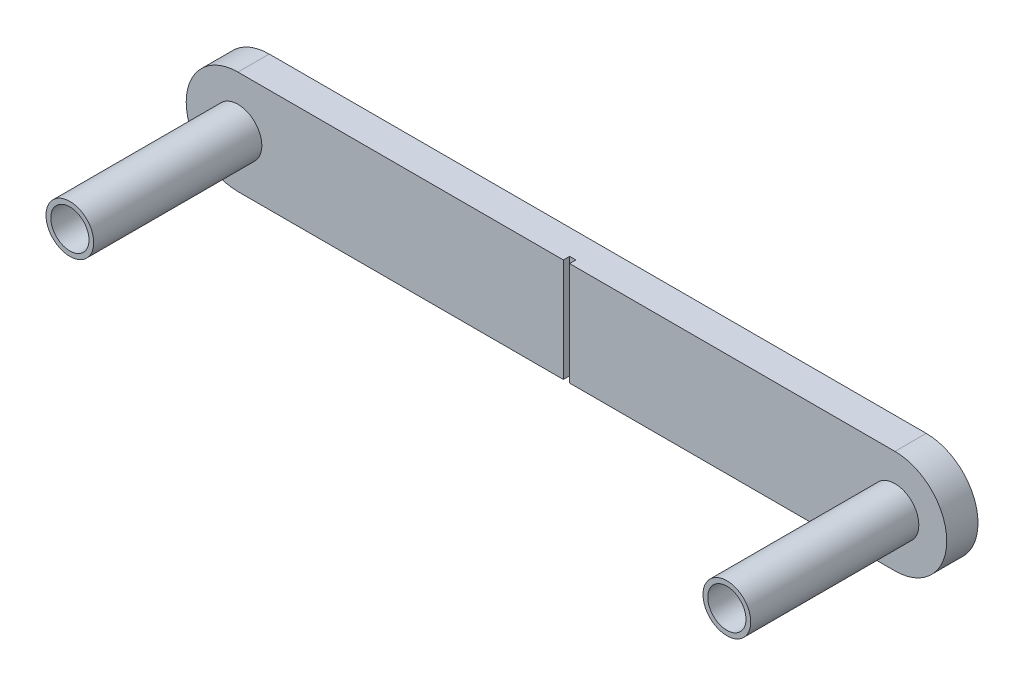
ISO-10303-21;
HEADER;
FILE_DESCRIPTION(('STEP AP214'),'2;1');
FILE_NAME('part.step','',(''),(''),'','','');
FILE_SCHEMA(('AUTOMOTIVE_DESIGN { 1 0 10303 214 1 1 1 1 }'));
ENDSEC;
DATA;
#1=APPLICATION_CONTEXT('core data for automotive mechanical design processes');
#2=APPLICATION_PROTOCOL_DEFINITION('international standard','automotive_design',2000,#1);
#3=PRODUCT_CONTEXT('',#1,'mechanical');
#4=PRODUCT('Part','Part','',(#3));
#5=PRODUCT_RELATED_PRODUCT_CATEGORY('part','',(#4));
#6=PRODUCT_DEFINITION_FORMATION('','',#4);
#7=PRODUCT_DEFINITION_CONTEXT('part definition',#1,'design');
#8=PRODUCT_DEFINITION('design','',#6,#7);
#9=PRODUCT_DEFINITION_SHAPE('','',#8);
#10=(LENGTH_UNIT() NAMED_UNIT(*) SI_UNIT(.MILLI.,.METRE.));
#11=(NAMED_UNIT(*) PLANE_ANGLE_UNIT() SI_UNIT($,.RADIAN.));
#12=(NAMED_UNIT(*) SI_UNIT($,.STERADIAN.) SOLID_ANGLE_UNIT());
#13=UNCERTAINTY_MEASURE_WITH_UNIT(LENGTH_MEASURE(1.E-05),#10,'distance_accuracy_value','');
#14=(GEOMETRIC_REPRESENTATION_CONTEXT(3) GLOBAL_UNCERTAINTY_ASSIGNED_CONTEXT((#13)) GLOBAL_UNIT_ASSIGNED_CONTEXT((#10,
#11,#12)) REPRESENTATION_CONTEXT('',''));
#15=CARTESIAN_POINT('',(0.,0.,0.));
#16=DIRECTION('',(0.,0.,1.));
#17=DIRECTION('',(1.,0.,0.));
#18=AXIS2_PLACEMENT_3D('',#15,#16,#17);
#19=CARTESIAN_POINT('',(353.595340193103,142.140968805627,-53.73));
#20=DIRECTION('',(0.,0.,-1.));
#21=DIRECTION('',(-1.,0.,0.));
#22=AXIS2_PLACEMENT_3D('',#19,#20,#21);
#23=PLANE('',#22);
#24=CARTESIAN_POINT('',(353.595340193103,142.140968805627,-53.73));
#25=DIRECTION('',(0.,0.,-1.));
#26=DIRECTION('',(-1.,0.,0.));
#27=AXIS2_PLACEMENT_3D('',#24,#25,#26);
#28=CIRCLE('',#27,7.62500000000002);
#29=CARTESIAN_POINT('',(345.970340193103,142.140968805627,-53.73));
#30=VERTEX_POINT('',#29);
#31=EDGE_CURVE('E149',#30,#30,#28,.F.);
#32=ORIENTED_EDGE('',*,*,#31,.F.);
#33=EDGE_LOOP('',(#32));
#34=FACE_BOUND('',#33,.T.);
#35=DIRECTION('',(1.,0.,0.));
#36=VECTOR('',#35,1.);
#37=CARTESIAN_POINT('',(143.595340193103,158.684747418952,-53.73));
#38=LINE('',#37,#36);
#39=CARTESIAN_POINT('',(249.595340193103,158.684747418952,-53.73));
#40=VERTEX_POINT('',#39);
#41=CARTESIAN_POINT('',(353.595340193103,158.684747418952,-53.73));
#42=VERTEX_POINT('',#41);
#43=EDGE_CURVE('E112',#40,#42,#38,.T.);
#44=ORIENTED_EDGE('',*,*,#43,.F.);
#45=DIRECTION('',(0.,1.,0.));
#46=VECTOR('',#45,1.);
#47=CARTESIAN_POINT('',(249.595340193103,158.684747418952,-53.73));
#48=LINE('',#47,#46);
#49=CARTESIAN_POINT('',(249.595340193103,125.597190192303,-53.73));
#50=VERTEX_POINT('',#49);
#51=EDGE_CURVE('E99',#50,#40,#48,.T.);
#52=ORIENTED_EDGE('',*,*,#51,.F.);
#53=DIRECTION('',(-1.,0.,0.));
#54=VECTOR('',#53,1.);
#55=CARTESIAN_POINT('',(353.595340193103,125.597190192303,-53.73));
#56=LINE('',#55,#54);
#57=CARTESIAN_POINT('',(353.595340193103,125.597190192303,-53.73));
#58=VERTEX_POINT('',#57);
#59=EDGE_CURVE('E128',#58,#50,#56,.T.);
#60=ORIENTED_EDGE('',*,*,#59,.F.);
#61=CARTESIAN_POINT('',(353.595340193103,142.140968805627,-53.73));
#62=DIRECTION('',(0.,0.,-1.));
#63=DIRECTION('',(-1.,0.,0.));
#64=AXIS2_PLACEMENT_3D('',#61,#62,#63);
#65=CIRCLE('',#64,16.5437786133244);
#66=EDGE_CURVE('E122',#42,#58,#65,.T.);
#67=ORIENTED_EDGE('',*,*,#66,.F.);
#68=EDGE_LOOP('',(#44,#52,#60,#67));
#69=FACE_BOUND('',#68,.T.);
#70=ADVANCED_FACE('F34',(#34,#69),#23,.F.);
#71=CARTESIAN_POINT('',(247.595340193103,125.597190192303,-53.73));
#72=VERTEX_POINT('',#71);
#73=CARTESIAN_POINT('',(143.595340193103,125.597190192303,-53.73));
#74=VERTEX_POINT('',#73);
#75=EDGE_CURVE('E196',#72,#74,#56,.T.);
#76=ORIENTED_EDGE('',*,*,#75,.F.);
#77=DIRECTION('',(0.,-1.,0.));
#78=VECTOR('',#77,1.);
#79=CARTESIAN_POINT('',(247.595340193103,158.684747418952,-53.73));
#80=LINE('',#79,#78);
#81=CARTESIAN_POINT('',(247.595340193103,158.684747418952,-53.73));
#82=VERTEX_POINT('',#81);
#83=EDGE_CURVE('E106',#82,#72,#80,.T.);
#84=ORIENTED_EDGE('',*,*,#83,.F.);
#85=CARTESIAN_POINT('',(143.595340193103,158.684747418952,-53.73));
#86=VERTEX_POINT('',#85);
#87=EDGE_CURVE('E123',#86,#82,#38,.T.);
#88=ORIENTED_EDGE('',*,*,#87,.F.);
#89=CARTESIAN_POINT('',(143.595340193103,142.140968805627,-53.73));
#90=DIRECTION('',(0.,0.,-1.));
#91=DIRECTION('',(1.,0.,0.));
#92=AXIS2_PLACEMENT_3D('',#89,#90,#91);
#93=CIRCLE('',#92,16.5437786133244);
#94=EDGE_CURVE('E124',#74,#86,#93,.T.);
#95=ORIENTED_EDGE('',*,*,#94,.F.);
#96=EDGE_LOOP('',(#76,#84,#88,#95));
#97=FACE_BOUND('',#96,.T.);
#98=CARTESIAN_POINT('',(143.595340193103,142.140968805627,-53.73));
#99=DIRECTION('',(0.,0.,-1.));
#100=DIRECTION('',(-1.,0.,0.));
#101=AXIS2_PLACEMENT_3D('',#98,#99,#100);
#102=CIRCLE('',#101,7.62499999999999);
#103=CARTESIAN_POINT('',(135.970340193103,142.140968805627,-53.73));
#104=VERTEX_POINT('',#103);
#105=EDGE_CURVE('E11',#104,#104,#102,.F.);
#106=ORIENTED_EDGE('',*,*,#105,.F.);
#107=EDGE_LOOP('',(#106));
#108=FACE_BOUND('',#107,.T.);
#109=ADVANCED_FACE('F157',(#97,#108),#23,.F.);
#110=CARTESIAN_POINT('',(353.595340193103,142.140968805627,-53.73));
#111=DIRECTION('',(0.,0.,1.));
#112=DIRECTION('',(1.,0.,0.));
#113=AXIS2_PLACEMENT_3D('',#110,#111,#112);
#114=CYLINDRICAL_SURFACE('',#113,7.62500000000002);
#115=ORIENTED_EDGE('',*,*,#31,.T.);
#116=EDGE_LOOP('',(#115));
#117=FACE_BOUND('',#116,.T.);
#118=CARTESIAN_POINT('',(353.595340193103,142.140968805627,0.));
#119=DIRECTION('',(0.,0.,1.));
#120=DIRECTION('',(1.,0.,0.));
#121=AXIS2_PLACEMENT_3D('',#118,#119,#120);
#122=CIRCLE('',#121,7.62500000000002);
#123=CARTESIAN_POINT('',(361.220340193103,142.140968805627,0.));
#124=VERTEX_POINT('',#123);
#125=EDGE_CURVE('E42',#124,#124,#122,.T.);
#126=ORIENTED_EDGE('',*,*,#125,.F.);
#127=EDGE_LOOP('',(#126));
#128=FACE_BOUND('',#127,.T.);
#129=ADVANCED_FACE('F36',(#117,#128),#114,.T.);
#130=CARTESIAN_POINT('',(353.595340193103,142.140968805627,0.));
#131=DIRECTION('',(0.,0.,1.));
#132=DIRECTION('',(1.,0.,0.));
#133=AXIS2_PLACEMENT_3D('',#130,#131,#132);
#134=PLANE('',#133);
#135=CARTESIAN_POINT('',(353.595340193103,142.140968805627,0.));
#136=DIRECTION('',(0.,0.,1.));
#137=DIRECTION('',(1.,0.,0.));
#138=AXIS2_PLACEMENT_3D('',#135,#136,#137);
#139=CIRCLE('',#138,6.11000000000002);
#140=CARTESIAN_POINT('',(359.705340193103,142.140968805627,0.));
#141=VERTEX_POINT('',#140);
#142=EDGE_CURVE('E261',#141,#141,#139,.T.);
#143=ORIENTED_EDGE('',*,*,#142,.F.);
#144=EDGE_LOOP('',(#143));
#145=FACE_BOUND('',#144,.T.);
#146=ORIENTED_EDGE('',*,*,#125,.T.);
#147=EDGE_LOOP('',(#146));
#148=FACE_BOUND('',#147,.T.);
#149=ADVANCED_FACE('F154',(#145,#148),#134,.T.);
#150=CARTESIAN_POINT('',(353.595340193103,142.140968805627,-63.73));
#151=DIRECTION('',(0.,0.,1.));
#152=DIRECTION('',(1.,0.,0.));
#153=AXIS2_PLACEMENT_3D('',#150,#151,#152);
#154=CYLINDRICAL_SURFACE('',#153,16.5437786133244);
#155=ORIENTED_EDGE('',*,*,#66,.T.);
#156=DIRECTION('',(0.,0.,1.));
#157=VECTOR('',#156,1.);
#158=CARTESIAN_POINT('',(353.595340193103,125.597190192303,-63.73));
#159=LINE('',#158,#157);
#160=CARTESIAN_POINT('',(353.595340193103,125.597190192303,-63.73));
#161=VERTEX_POINT('',#160);
#162=EDGE_CURVE('E146',#161,#58,#159,.T.);
#163=ORIENTED_EDGE('',*,*,#162,.F.);
#164=CARTESIAN_POINT('',(353.595340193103,142.140968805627,-63.73));
#165=DIRECTION('',(0.,0.,-1.));
#166=DIRECTION('',(-1.,0.,0.));
#167=AXIS2_PLACEMENT_3D('',#164,#165,#166);
#168=CIRCLE('',#167,16.5437786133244);
#169=CARTESIAN_POINT('',(353.595340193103,158.684747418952,-63.73));
#170=VERTEX_POINT('',#169);
#171=EDGE_CURVE('E127',#170,#161,#168,.T.);
#172=ORIENTED_EDGE('',*,*,#171,.F.);
#173=DIRECTION('',(0.,0.,1.));
#174=VECTOR('',#173,1.);
#175=CARTESIAN_POINT('',(353.595340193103,158.684747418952,-63.73));
#176=LINE('',#175,#174);
#177=EDGE_CURVE('E138',#170,#42,#176,.T.);
#178=ORIENTED_EDGE('',*,*,#177,.T.);
#179=EDGE_LOOP('',(#155,#163,#172,#178));
#180=FACE_BOUND('',#179,.T.);
#181=ADVANCED_FACE('F163',(#180),#154,.T.);
#182=CARTESIAN_POINT('',(353.595340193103,125.597190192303,-63.73));
#183=DIRECTION('',(0.,1.,0.));
#184=DIRECTION('',(0.,0.,1.));
#185=AXIS2_PLACEMENT_3D('',#182,#183,#184);
#186=PLANE('',#185);
#187=ORIENTED_EDGE('',*,*,#59,.T.);
#188=DIRECTION('',(0.,0.,-1.));
#189=VECTOR('',#188,1.);
#190=CARTESIAN_POINT('',(249.595340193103,125.597190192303,-63.73));
#191=LINE('',#190,#189);
#192=CARTESIAN_POINT('',(249.595340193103,125.597190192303,-55.73));
#193=VERTEX_POINT('',#192);
#194=EDGE_CURVE('E102',#50,#193,#191,.T.);
#195=ORIENTED_EDGE('',*,*,#194,.T.);
#196=DIRECTION('',(1.,0.,0.));
#197=VECTOR('',#196,1.);
#198=CARTESIAN_POINT('',(353.595340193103,125.597190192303,-55.73));
#199=LINE('',#198,#197);
#200=CARTESIAN_POINT('',(247.595340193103,125.597190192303,-55.73));
#201=VERTEX_POINT('',#200);
#202=EDGE_CURVE('E221',#201,#193,#199,.T.);
#203=ORIENTED_EDGE('',*,*,#202,.F.);
#204=DIRECTION('',(0.,0.,1.));
#205=VECTOR('',#204,1.);
#206=CARTESIAN_POINT('',(247.595340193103,125.597190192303,-63.73));
#207=LINE('',#206,#205);
#208=EDGE_CURVE('E224',#201,#72,#207,.T.);
#209=ORIENTED_EDGE('',*,*,#208,.T.);
#210=ORIENTED_EDGE('',*,*,#75,.T.);
#211=DIRECTION('',(0.,0.,1.));
#212=VECTOR('',#211,1.);
#213=CARTESIAN_POINT('',(143.595340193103,125.597190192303,-63.73));
#214=LINE('',#213,#212);
#215=CARTESIAN_POINT('',(143.595340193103,125.597190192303,-63.73));
#216=VERTEX_POINT('',#215);
#217=EDGE_CURVE('E143',#216,#74,#214,.T.);
#218=ORIENTED_EDGE('',*,*,#217,.F.);
#219=DIRECTION('',(-1.,0.,0.));
#220=VECTOR('',#219,1.);
#221=CARTESIAN_POINT('',(353.595340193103,125.597190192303,-63.73));
#222=LINE('',#221,#220);
#223=EDGE_CURVE('E133',#161,#216,#222,.T.);
#224=ORIENTED_EDGE('',*,*,#223,.F.);
#225=ORIENTED_EDGE('',*,*,#162,.T.);
#226=EDGE_LOOP('',(#187,#195,#203,#209,#210,#218,#224,#225));
#227=FACE_BOUND('',#226,.T.);
#228=ADVANCED_FACE('F185',(#227),#186,.F.);
#229=CARTESIAN_POINT('',(143.595340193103,142.140968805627,-63.73));
#230=DIRECTION('',(0.,0.,1.));
#231=DIRECTION('',(1.,0.,0.));
#232=AXIS2_PLACEMENT_3D('',#229,#230,#231);
#233=CYLINDRICAL_SURFACE('',#232,16.5437786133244);
#234=ORIENTED_EDGE('',*,*,#94,.T.);
#235=DIRECTION('',(0.,0.,1.));
#236=VECTOR('',#235,1.);
#237=CARTESIAN_POINT('',(143.595340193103,158.684747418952,-63.73));
#238=LINE('',#237,#236);
#239=CARTESIAN_POINT('',(143.595340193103,158.684747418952,-63.73));
#240=VERTEX_POINT('',#239);
#241=EDGE_CURVE('E140',#240,#86,#238,.T.);
#242=ORIENTED_EDGE('',*,*,#241,.F.);
#243=CARTESIAN_POINT('',(143.595340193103,142.140968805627,-63.73));
#244=DIRECTION('',(0.,0.,-1.));
#245=DIRECTION('',(1.,0.,0.));
#246=AXIS2_PLACEMENT_3D('',#243,#244,#245);
#247=CIRCLE('',#246,16.5437786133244);
#248=EDGE_CURVE('E135',#216,#240,#247,.T.);
#249=ORIENTED_EDGE('',*,*,#248,.F.);
#250=ORIENTED_EDGE('',*,*,#217,.T.);
#251=EDGE_LOOP('',(#234,#242,#249,#250));
#252=FACE_BOUND('',#251,.T.);
#253=ADVANCED_FACE('F182',(#252),#233,.T.);
#254=CARTESIAN_POINT('',(143.595340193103,158.684747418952,-63.73));
#255=DIRECTION('',(0.,-1.,0.));
#256=DIRECTION('',(0.,0.,-1.));
#257=AXIS2_PLACEMENT_3D('',#254,#255,#256);
#258=PLANE('',#257);
#259=DIRECTION('',(-1.,0.,0.));
#260=VECTOR('',#259,1.);
#261=CARTESIAN_POINT('',(247.595340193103,158.684747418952,-55.73));
#262=LINE('',#261,#260);
#263=CARTESIAN_POINT('',(249.595340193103,158.684747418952,-55.73));
#264=VERTEX_POINT('',#263);
#265=CARTESIAN_POINT('',(247.595340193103,158.684747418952,-55.73));
#266=VERTEX_POINT('',#265);
#267=EDGE_CURVE('E116',#264,#266,#262,.T.);
#268=ORIENTED_EDGE('',*,*,#267,.F.);
#269=DIRECTION('',(0.,0.,1.));
#270=VECTOR('',#269,1.);
#271=CARTESIAN_POINT('',(249.595340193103,158.684747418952,-55.73));
#272=LINE('',#271,#270);
#273=EDGE_CURVE('E49',#264,#40,#272,.T.);
#274=ORIENTED_EDGE('',*,*,#273,.T.);
#275=ORIENTED_EDGE('',*,*,#43,.T.);
#276=ORIENTED_EDGE('',*,*,#177,.F.);
#277=DIRECTION('',(1.,0.,0.));
#278=VECTOR('',#277,1.);
#279=CARTESIAN_POINT('',(143.595340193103,158.684747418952,-63.73));
#280=LINE('',#279,#278);
#281=EDGE_CURVE('E57',#240,#170,#280,.T.);
#282=ORIENTED_EDGE('',*,*,#281,.F.);
#283=ORIENTED_EDGE('',*,*,#241,.T.);
#284=ORIENTED_EDGE('',*,*,#87,.T.);
#285=DIRECTION('',(0.,0.,1.));
#286=VECTOR('',#285,1.);
#287=CARTESIAN_POINT('',(247.595340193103,158.684747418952,-55.73));
#288=LINE('',#287,#286);
#289=EDGE_CURVE('E117',#266,#82,#288,.T.);
#290=ORIENTED_EDGE('',*,*,#289,.F.);
#291=EDGE_LOOP('',(#268,#274,#275,#276,#282,#283,#284,#290));
#292=FACE_BOUND('',#291,.T.);
#293=ADVANCED_FACE('F111',(#292),#258,.F.);
#294=CARTESIAN_POINT('',(353.595340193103,142.140968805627,-63.73));
#295=DIRECTION('',(0.,0.,-1.));
#296=DIRECTION('',(-1.,0.,0.));
#297=AXIS2_PLACEMENT_3D('',#294,#295,#296);
#298=PLANE('',#297);
#299=CARTESIAN_POINT('',(353.595340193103,142.140968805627,-63.73));
#300=DIRECTION('',(0.,0.,1.));
#301=DIRECTION('',(1.,0.,0.));
#302=AXIS2_PLACEMENT_3D('',#299,#300,#301);
#303=CIRCLE('',#302,6.11000000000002);
#304=CARTESIAN_POINT('',(359.705340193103,142.140968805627,-63.73));
#305=VERTEX_POINT('',#304);
#306=EDGE_CURVE('E257',#305,#305,#303,.T.);
#307=ORIENTED_EDGE('',*,*,#306,.T.);
#308=EDGE_LOOP('',(#307));
#309=FACE_BOUND('',#308,.T.);
#310=CARTESIAN_POINT('',(143.595340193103,142.140968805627,-63.73));
#311=DIRECTION('',(0.,0.,1.));
#312=DIRECTION('',(1.,0.,0.));
#313=AXIS2_PLACEMENT_3D('',#310,#311,#312);
#314=CIRCLE('',#313,6.11);
#315=CARTESIAN_POINT('',(149.705340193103,142.140968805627,-63.73));
#316=VERTEX_POINT('',#315);
#317=EDGE_CURVE('E107',#316,#316,#314,.T.);
#318=ORIENTED_EDGE('',*,*,#317,.T.);
#319=EDGE_LOOP('',(#318));
#320=FACE_BOUND('',#319,.T.);
#321=ORIENTED_EDGE('',*,*,#171,.T.);
#322=ORIENTED_EDGE('',*,*,#223,.T.);
#323=ORIENTED_EDGE('',*,*,#248,.T.);
#324=ORIENTED_EDGE('',*,*,#281,.T.);
#325=EDGE_LOOP('',(#321,#322,#323,#324));
#326=FACE_BOUND('',#325,.T.);
#327=ADVANCED_FACE('F176',(#309,#320,#326),#298,.T.);
#328=CARTESIAN_POINT('',(143.595340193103,142.140968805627,0.));
#329=DIRECTION('',(0.,0.,-1.));
#330=DIRECTION('',(-1.,0.,0.));
#331=AXIS2_PLACEMENT_3D('',#328,#329,#330);
#332=CYLINDRICAL_SURFACE('',#331,7.62499999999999);
#333=CARTESIAN_POINT('',(143.595340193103,142.140968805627,0.));
#334=DIRECTION('',(0.,0.,1.));
#335=DIRECTION('',(1.,0.,0.));
#336=AXIS2_PLACEMENT_3D('',#333,#334,#335);
#337=CIRCLE('',#336,7.62499999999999);
#338=CARTESIAN_POINT('',(151.220340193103,142.140968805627,0.));
#339=VERTEX_POINT('',#338);
#340=EDGE_CURVE('E197',#339,#339,#337,.T.);
#341=ORIENTED_EDGE('',*,*,#340,.F.);
#342=EDGE_LOOP('',(#341));
#343=FACE_BOUND('',#342,.T.);
#344=ORIENTED_EDGE('',*,*,#105,.T.);
#345=EDGE_LOOP('',(#344));
#346=FACE_BOUND('',#345,.T.);
#347=ADVANCED_FACE('F174',(#343,#346),#332,.T.);
#348=CARTESIAN_POINT('',(143.595340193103,142.140968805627,0.));
#349=DIRECTION('',(0.,0.,1.));
#350=DIRECTION('',(1.,0.,0.));
#351=AXIS2_PLACEMENT_3D('',#348,#349,#350);
#352=PLANE('',#351);
#353=CARTESIAN_POINT('',(143.595340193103,142.140968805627,0.));
#354=DIRECTION('',(0.,0.,1.));
#355=DIRECTION('',(1.,0.,0.));
#356=AXIS2_PLACEMENT_3D('',#353,#354,#355);
#357=CIRCLE('',#356,6.11);
#358=CARTESIAN_POINT('',(149.705340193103,142.140968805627,0.));
#359=VERTEX_POINT('',#358);
#360=EDGE_CURVE('E252',#359,#359,#357,.T.);
#361=ORIENTED_EDGE('',*,*,#360,.F.);
#362=EDGE_LOOP('',(#361));
#363=FACE_BOUND('',#362,.T.);
#364=ORIENTED_EDGE('',*,*,#340,.T.);
#365=EDGE_LOOP('',(#364));
#366=FACE_BOUND('',#365,.T.);
#367=ADVANCED_FACE('F242',(#363,#366),#352,.T.);
#368=CARTESIAN_POINT('',(249.595340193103,158.684747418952,-55.73));
#369=DIRECTION('',(1.,0.,0.));
#370=DIRECTION('',(0.,0.,-1.));
#371=AXIS2_PLACEMENT_3D('',#368,#369,#370);
#372=PLANE('',#371);
#373=ORIENTED_EDGE('',*,*,#51,.T.);
#374=ORIENTED_EDGE('',*,*,#273,.F.);
#375=DIRECTION('',(0.,1.,0.));
#376=VECTOR('',#375,1.);
#377=CARTESIAN_POINT('',(249.595340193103,158.684747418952,-55.73));
#378=LINE('',#377,#376);
#379=EDGE_CURVE('E213',#193,#264,#378,.T.);
#380=ORIENTED_EDGE('',*,*,#379,.F.);
#381=ORIENTED_EDGE('',*,*,#194,.F.);
#382=EDGE_LOOP('',(#373,#374,#380,#381));
#383=FACE_BOUND('',#382,.T.);
#384=ADVANCED_FACE('F100',(#383),#372,.F.);
#385=CARTESIAN_POINT('',(247.595340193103,158.684747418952,-55.73));
#386=DIRECTION('',(-1.,0.,0.));
#387=DIRECTION('',(0.,0.,1.));
#388=AXIS2_PLACEMENT_3D('',#385,#386,#387);
#389=PLANE('',#388);
#390=DIRECTION('',(0.,-1.,0.));
#391=VECTOR('',#390,1.);
#392=CARTESIAN_POINT('',(247.595340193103,158.684747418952,-55.73));
#393=LINE('',#392,#391);
#394=EDGE_CURVE('E118',#266,#201,#393,.T.);
#395=ORIENTED_EDGE('',*,*,#394,.F.);
#396=ORIENTED_EDGE('',*,*,#289,.T.);
#397=ORIENTED_EDGE('',*,*,#83,.T.);
#398=ORIENTED_EDGE('',*,*,#208,.F.);
#399=EDGE_LOOP('',(#395,#396,#397,#398));
#400=FACE_BOUND('',#399,.T.);
#401=ADVANCED_FACE('F225',(#400),#389,.F.);
#402=CARTESIAN_POINT('',(249.595340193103,125.214581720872,-55.73));
#403=DIRECTION('',(0.,0.,1.));
#404=DIRECTION('',(1.,0.,0.));
#405=AXIS2_PLACEMENT_3D('',#402,#403,#404);
#406=PLANE('',#405);
#407=ORIENTED_EDGE('',*,*,#202,.T.);
#408=ORIENTED_EDGE('',*,*,#379,.T.);
#409=ORIENTED_EDGE('',*,*,#267,.T.);
#410=ORIENTED_EDGE('',*,*,#394,.T.);
#411=EDGE_LOOP('',(#407,#408,#409,#410));
#412=FACE_BOUND('',#411,.T.);
#413=ADVANCED_FACE('F227',(#412),#406,.T.);
#414=CARTESIAN_POINT('',(143.595340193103,142.140968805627,-63.73));
#415=DIRECTION('',(0.,0.,1.));
#416=DIRECTION('',(1.,0.,0.));
#417=AXIS2_PLACEMENT_3D('',#414,#415,#416);
#418=CYLINDRICAL_SURFACE('',#417,6.11);
#419=ORIENTED_EDGE('',*,*,#317,.F.);
#420=EDGE_LOOP('',(#419));
#421=FACE_BOUND('',#420,.T.);
#422=ORIENTED_EDGE('',*,*,#360,.T.);
#423=EDGE_LOOP('',(#422));
#424=FACE_BOUND('',#423,.T.);
#425=ADVANCED_FACE('F229',(#421,#424),#418,.F.);
#426=CARTESIAN_POINT('',(353.595340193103,142.140968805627,-63.73));
#427=DIRECTION('',(0.,0.,1.));
#428=DIRECTION('',(1.,0.,0.));
#429=AXIS2_PLACEMENT_3D('',#426,#427,#428);
#430=CYLINDRICAL_SURFACE('',#429,6.11000000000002);
#431=ORIENTED_EDGE('',*,*,#306,.F.);
#432=EDGE_LOOP('',(#431));
#433=FACE_BOUND('',#432,.T.);
#434=ORIENTED_EDGE('',*,*,#142,.T.);
#435=EDGE_LOOP('',(#434));
#436=FACE_BOUND('',#435,.T.);
#437=ADVANCED_FACE('F235',(#433,#436),#430,.F.);
#438=CLOSED_SHELL('',(#70,#109,#129,#149,#181,#228,#253,#293,#327,#347,#367,#384,#401,#413,#425,#437));
#439=MANIFOLD_SOLID_BREP('B2',#438);
#440=ADVANCED_BREP_SHAPE_REPRESENTATION('',(#18,#439),#14);
#441=SHAPE_DEFINITION_REPRESENTATION(#9,#440);
ENDSEC;
END-ISO-10303-21;
